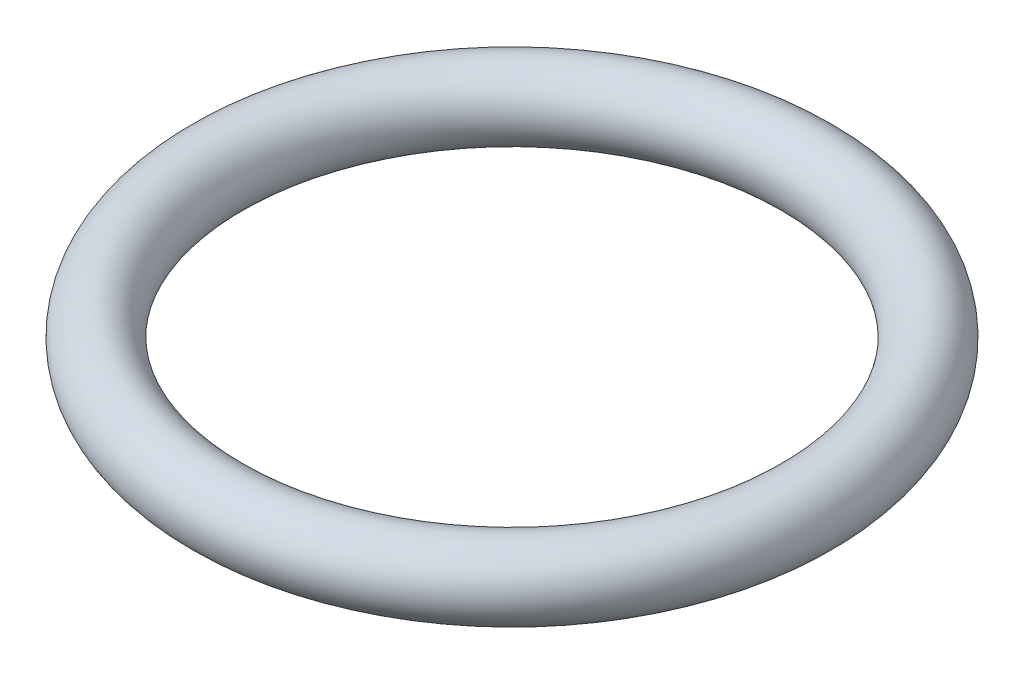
from build123d import *

# Parameters (mm, degrees)
ESQUISSE1_R = 3


with BuildPart() as part:
    # Esquisse1 → R_volution1 (revolve)
    with BuildSketch(Plane.XY, mode=Mode.PRIVATE) as r_volution1_sk:
        with Locations((25, 3)):
            Circle(ESQUISSE1_R)
    revolve(r_volution1_sk.sketch.rotate(Axis((0, 45.569153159, 0), (0, -1, 0)), 90), axis=Axis((0, 45.569153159, 0), (0, -1, 0)))


solid = part.part
